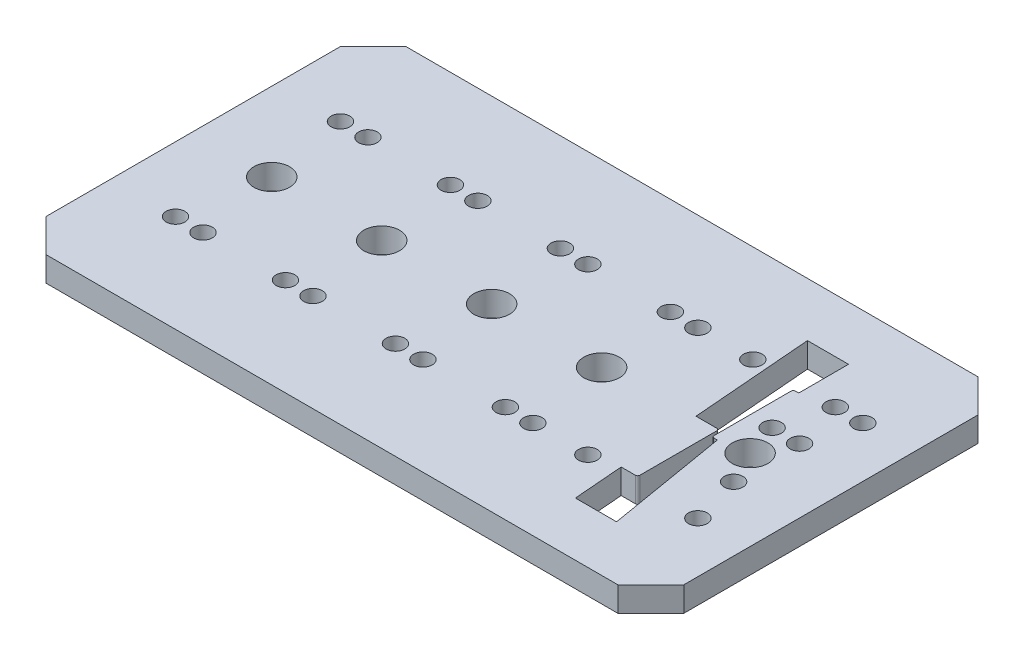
from build123d import *

# Parameters (mm, degrees)
SKETCH11_R          = 3.25
SKETCH11_R_2        = 1.7
BOSS_EXTRUDE4_DEPTH = 4.5


with BuildPart() as part:
    # Sketch11 → Boss-Extrude4 (new body)
    with BuildSketch(Plane(origin=(0, 0, 0), x_dir=(1, 0, 0), z_dir=(0, 1, 0))):
        Polygon((-47, 32.75), (-53, 26.75), (-53, -26.75), (-47, -32.75), (57, -32.75), (63, -26.75), (63, 26.75), (57, 32.75), align=None)
        with Locations(Location((-38.7, 0, 0), (0, 0, 270))):
            Circle(SKETCH11_R, mode=Mode.SUBTRACT)
        with Locations(Location((-41.2, 15, 0), (0, 0, 270))):
            Circle(SKETCH11_R_2, mode=Mode.SUBTRACT)
        with Locations(Location((48.3, 0, 0), (0, 0, 270))):
            Circle(SKETCH11_R, mode=Mode.SUBTRACT)
        with Locations(Location((-21.2, 15, 0), (0, 0, 270))):
            Circle(SKETCH11_R_2, mode=Mode.SUBTRACT)
        with Locations(Location((-36.2, 15, 0), (0, 0, 270))):
            Circle(SKETCH11_R_2, mode=Mode.SUBTRACT)
        with Locations(Location((-16.2, 15, 0), (0, 0, 270))):
            Circle(SKETCH11_R_2, mode=Mode.SUBTRACT)
        with Locations(Location((-1.2, 15, 0), (0, 0, 270))):
            Circle(SKETCH11_R_2, mode=Mode.SUBTRACT)
        with Locations(Location((3.8, 15, 0), (0, 0, 270))):
            Circle(SKETCH11_R_2, mode=Mode.SUBTRACT)
        with Locations(Location((18.8, 15, 0), (0, 0, 270))):
            Circle(SKETCH11_R_2, mode=Mode.SUBTRACT)
        with Locations(Location((23.8, 15, 0), (0, 0, 270))):
            Circle(SKETCH11_R_2, mode=Mode.SUBTRACT)
        with Locations(Location((-18.7, 0, 0), (0, 0, 270))):
            Circle(SKETCH11_R, mode=Mode.SUBTRACT)
        with Locations(Location((53.8, 15, 0), (0, 0, 270))):
            Circle(SKETCH11_R_2, mode=Mode.SUBTRACT)
        with Locations(Location((33.8, -15, 0), (0, 0, 90))):
            Circle(SKETCH11_R_2, mode=Mode.SUBTRACT)
        with Locations(Location((33.8, 15, 0), (0, 0, 270))):
            Circle(SKETCH11_R_2, mode=Mode.SUBTRACT)
        with Locations(Location((48.8, 15, 0), (0, 0, 270))):
            Circle(SKETCH11_R_2, mode=Mode.SUBTRACT)
        with Locations(Location((53.8, -15, 0), (0, 0, 90))):
            Circle(SKETCH11_R_2, mode=Mode.SUBTRACT)
        with Locations(Location((23.8, -15, 0), (0, 0, 90))):
            Circle(SKETCH11_R_2, mode=Mode.SUBTRACT)
        with Locations(Location((18.8, -15, 0), (0, 0, 90))):
            Circle(SKETCH11_R_2, mode=Mode.SUBTRACT)
        with Locations(Location((3.8, -15, 0), (0, 0, 90))):
            Circle(SKETCH11_R_2, mode=Mode.SUBTRACT)
        with Locations(Location((-1.2, -15, 0), (0, 0, 90))):
            Circle(SKETCH11_R_2, mode=Mode.SUBTRACT)
        with Locations(Location((-16.2, -15, 0), (0, 0, 90))):
            Circle(SKETCH11_R_2, mode=Mode.SUBTRACT)
        with Locations(Location((-36.2, -15, 0), (0, 0, 90))):
            Circle(SKETCH11_R_2, mode=Mode.SUBTRACT)
        with Locations(Location((-21.2, -15, 0), (0, 0, 90))):
            Circle(SKETCH11_R_2, mode=Mode.SUBTRACT)
        with Locations(Location((-41.2, -15, 0), (0, 0, 90))):
            Circle(SKETCH11_R_2, mode=Mode.SUBTRACT)
        with Locations(Location((1.3, 0, 0), (0, 0, 270))):
            Circle(SKETCH11_R, mode=Mode.SUBTRACT)
        with Locations(Location((21.3, 0, 0), (0, 0, 270))):
            Circle(SKETCH11_R, mode=Mode.SUBTRACT)
        with Locations(Location((46.3, 6, 0), (0, 0, 270))):
            Circle(SKETCH11_R_2, mode=Mode.SUBTRACT)
        with Locations(Location((51.3, 6, 0), (0, 0, 270))):
            Circle(SKETCH11_R_2, mode=Mode.SUBTRACT)
        with Locations(Location((51.3, -6, 0), (0, 0, 270))):
            Circle(SKETCH11_R_2, mode=Mode.SUBTRACT)
        with BuildLine():
            Line((41.75, -13.5), (41.75, 0.5))
            ThreePointArc((41.75, 0.5), (41.632842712, 0.782842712), (41.35, 0.9))
            Line((41.35, 0.9), (37.561166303, 0.9))
            Line((37.561166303, 0.9), (35.78322444, 22.95))
            Line((35.78322444, 22.95), (43.25, 22.95))
            Line((43.25, 22.95), (43.25, 13.9))
            Line((43.25, 13.9), (42.65, 13.9))
            ThreePointArc((42.65, 13.9), (42.367157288, 13.782842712), (42.25, 13.5))
            Line((42.25, 13.5), (42.25, -0.5))
            ThreePointArc((42.25, -0.5), (42.367157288, -0.782842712), (42.65, -0.9))
            Line((42.65, -0.9), (43.25, -0.9))
            Line((43.25, -0.9), (46.966292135, -22.95))
            Line((46.966292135, -22.95), (39.484246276, -22.95))
            Line((39.484246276, -22.95), (38.754524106, -13.9))
            Line((38.754524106, -13.9), (41.35, -13.9))
            ThreePointArc((41.35, -13.9), (41.632842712, -13.782842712), (41.75, -13.5))
        make_face(mode=Mode.SUBTRACT)
    extrude(amount=BOSS_EXTRUDE4_DEPTH)


solid = part.part
